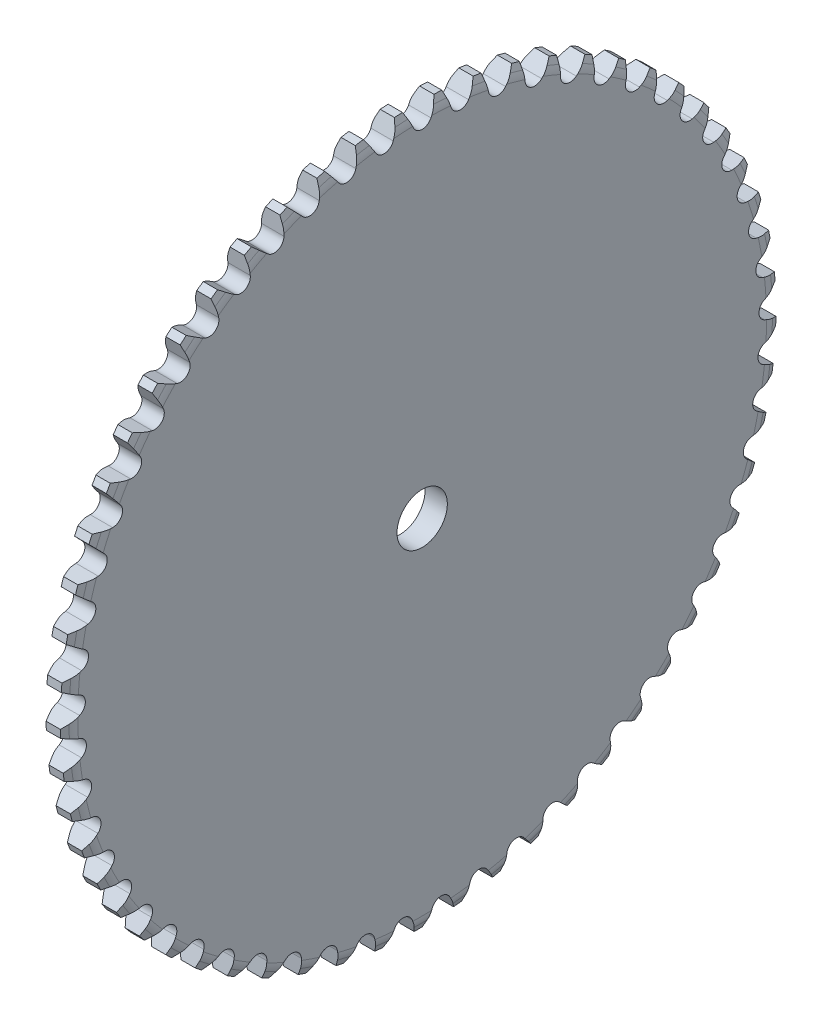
from build123d import *

# Parameters (mm, degrees)
ENL_V_MAT_EXTRU_1_DEPTH      = 11.1
ENL_V_MAT_EXTRU_1_DEPTH_BACK = 11.1
ESQUISSE2_R                  = 266.55


with BuildPart() as part:
    # Esquisse1 → R_volution1 (revolve)
    with BuildSketch(Plane.XY, mode=Mode.PRIVATE) as r_volution1_sk:
        with BuildLine():
            Line((0, 12.5), (11.1, 12.5))
            Line((11.1, 12.5), (11.1, 171.003171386))
            ThreePointArc((11.1, 171.003171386), (10.915171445, 172.867998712), (10.367877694, 174.660263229))
            Line((10.367877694, 174.660263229), (9.1, 177.7))
            Line((9.1, 177.7), (2, 177.7))
            Line((2, 177.7), (0.732122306, 174.660263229))
            ThreePointArc((0.732122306, 174.660263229), (0.184828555, 172.867998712), (0, 171.003171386))
            Line((0, 171.003171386), (0, 12.5))
        make_face()
    revolve(r_volution1_sk.sketch.rotate(Axis((11.1, 0, 0), (-1, 0, 0)), 180), axis=Axis((11.1, 0, 0), (-1, 0, 0)))

    # Esquisse2 → Enl_v. mat.-Extru.1 (cut, two sides: drawn at the far end of the back side and taken through both)
    with BuildSketch(Plane(origin=(5.55, 0, 0), x_dir=(0, 0, -1), z_dir=(1, 0, 0)).offset(-ENL_V_MAT_EXTRU_1_DEPTH_BACK)):
        Circle(ESQUISSE2_R)
        with BuildLine():
            Line((-177.676126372, -2.912750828), (-177.566785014, -6.879452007))
            Line((-177.566785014, -6.879452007), (-169.882751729, -9.716246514))
            ThreePointArc((-169.882751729, -9.716246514), (-166.764793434, -13.818524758), (-169.165014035, -18.378052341))
            Line((-169.165014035, -18.378052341), (-176.277326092, -22.440906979))
            Line((-176.277326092, -22.440906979), (-175.732278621, -26.37150452))
            Line((-175.732278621, -26.37150452), (-167.782811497, -28.345774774))
            ThreePointArc((-167.782811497, -28.345774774), (-164.232492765, -32.080153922), (-166.116560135, -36.87605226))
            Line((-166.116560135, -36.87605226), (-172.738757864, -41.696660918))
            Line((-172.738757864, -41.696660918), (-171.764620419, -45.543442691))
            Line((-171.764620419, -45.543442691), (-163.646215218, -46.631223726))
            ThreePointArc((-163.646215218, -46.631223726), (-159.706632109, -49.952373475), (-161.051676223, -54.926426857))
            Line((-161.051676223, -54.926426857), (-167.103375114, -60.446273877))
            Line((-167.103375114, -60.446273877), (-165.711972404, -64.162545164))
            Line((-165.711972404, -64.162545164), (-157.523175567, -64.350632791))
            ThreePointArc((-157.523175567, -64.350632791), (-153.242149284, -67.218238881), (-154.031843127, -72.310069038))
            Line((-154.031843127, -72.310069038), (-159.439583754, -78.462150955))
            Line((-159.439583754, -78.462150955), (-157.647805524, -82.002801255))
            Line((-157.647805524, -82.002801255), (-149.488017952, -81.288912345))
            ThreePointArc((-149.488017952, -81.288912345), (-144.917514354, -83.668165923), (-145.142272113, -88.815964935))
            Line((-145.142272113, -88.815964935), (-149.84041183, -95.525603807))
            Line((-149.84041183, -95.525603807), (-147.670007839, -98.847654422))
            Line((-147.670007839, -98.847654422), (-139.6382783, -97.240454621))
            ThreePointArc((-139.6382783, -97.240454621), (-134.83377711, -99.102474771), (-134.49087053, -104.243755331))
            Line((-134.49087053, -104.243755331), (-138.422380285, -111.429505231))
            Line((-138.422380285, -111.429505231), (-135.899696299, -114.492630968))
            Line((-135.899696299, -114.492630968), (-128.093519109, -112.011629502))
            ThreePointArc((-128.093519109, -112.011629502), (-123.113340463, -113.333813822), (-122.206931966, -118.406167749))
            Line((-122.206931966, -118.406167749), (-125.324088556, -125.980803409))
            Line((-125.324088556, -125.980803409), (-122.47974654, -128.747822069))
            Line((-122.47974654, -128.747822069), (-114.993878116, -125.423134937))
            ThreePointArc((-114.993878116, -125.423134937), (-109.898474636, -126.1894339), (-108.439566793, -131.131289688))
            Line((-108.439566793, -131.131289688), (-110.704532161, -139.002865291))
            Line((-110.704532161, -139.002865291), (-107.573058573, -141.440189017))
            Line((-107.573058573, -141.440189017), (-100.498367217, -137.312173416))
            ThreePointArc((-100.498367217, -137.312173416), (-95.3495902, -137.513285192), (-93.355892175, -142.264655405))
            Line((-93.355892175, -142.264655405), (-94.741172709, -150.337620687))
            Line((-94.741172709, -150.337620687), (-91.360579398, -152.41566367))
            Line((-91.360579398, -152.41566367), (-84.782942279, -147.534428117))
            ThreePointArc((-84.782942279, -147.534428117), (-79.643290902, -147.167911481), (-77.13900349, -151.671120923))
            Line((-77.13900349, -151.671120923), (-77.62778376, -159.84748102))
            Line((-77.62778376, -159.84748102), (-74.039106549, -161.541018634))
            Line((-74.039106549, -161.541018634), (-68.038367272, -155.965814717))
            ThreePointArc((-68.038367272, -155.965814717), (-62.970229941, -155.036118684), (-59.985751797, -159.236504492))
            Line((-59.985751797, -159.236504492), (-59.572098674, -167.417009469))
            Line((-59.572098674, -167.417009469), (-55.818899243, -168.705484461))
            Line((-55.818899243, -168.705484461), (-50.467898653, -162.503987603))
            ThreePointArc((-50.467898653, -162.503987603), (-45.53279569, -161.022397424), (-42.104354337, -164.868972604))
            Line((-42.104354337, -164.868972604), (-40.793289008, -172.954322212))
            Line((-40.793289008, -172.954322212), (-36.921126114, -173.822094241))
            Line((-36.921126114, -173.822094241), (-32.284818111, -167.069582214))
            ThreePointArc((-32.284818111, -167.069582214), (-27.542654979, -165.054082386), (-23.711867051, -168.500154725))
            Line((-23.711867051, -168.500154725), (-21.519304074, -176.392203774))
            Line((-21.519304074, -176.392203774), (-17.575180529, -176.828739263))
            Line((-17.575180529, -176.828739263), (-13.70984361, -169.607178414))
            ThreePointArc((-13.70984361, -169.607178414), (-9.218183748, -167.082234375), (-5.03154982, -170.085973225))
            Line((-5.03154982, -170.085973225), (-1.98410394, -177.688922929))
            Line((-1.98410394, -177.688922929), (1.98410394, -177.688922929))
            Line((1.98410394, -177.688922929), (5.03154982, -170.085973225))
            ThreePointArc((5.03154982, -170.085973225), (9.218183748, -167.082234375), (13.70984361, -169.607178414))
            Line((13.70984361, -169.607178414), (17.575180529, -176.828739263))
            Line((17.575180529, -176.828739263), (21.519304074, -176.392203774))
            Line((21.519304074, -176.392203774), (23.711867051, -168.500154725))
            ThreePointArc((23.711867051, -168.500154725), (27.542654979, -165.054082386), (32.284818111, -167.069582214))
            Line((32.284818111, -167.069582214), (36.921126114, -173.822094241))
            Line((36.921126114, -173.822094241), (40.793289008, -172.954322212))
            Line((40.793289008, -172.954322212), (42.104354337, -164.868972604))
            ThreePointArc((42.104354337, -164.868972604), (45.53279569, -161.022397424), (50.467898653, -162.503987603))
            Line((50.467898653, -162.503987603), (55.818899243, -168.705484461))
            Line((55.818899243, -168.705484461), (59.572098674, -167.417009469))
            Line((59.572098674, -167.417009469), (59.985751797, -159.236504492))
            ThreePointArc((59.985751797, -159.236504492), (62.970229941, -155.036118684), (68.038367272, -155.965814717))
            Line((68.038367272, -155.965814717), (74.039106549, -161.541018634))
            Line((74.039106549, -161.541018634), (77.62778376, -159.84748102))
            Line((77.62778376, -159.84748102), (77.13900349, -151.671120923))
            ThreePointArc((77.13900349, -151.671120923), (79.643290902, -147.167911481), (84.782942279, -147.534428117))
            Line((84.782942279, -147.534428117), (91.360579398, -152.41566367))
            Line((91.360579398, -152.41566367), (94.741172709, -150.337620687))
            Line((94.741172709, -150.337620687), (93.355892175, -142.264655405))
            ThreePointArc((93.355892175, -142.264655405), (95.3495902, -137.513285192), (100.498367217, -137.312173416))
            Line((100.498367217, -137.312173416), (107.573058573, -141.440189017))
            Line((107.573058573, -141.440189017), (110.704532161, -139.002865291))
            Line((110.704532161, -139.002865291), (108.439566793, -131.131289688))
            ThreePointArc((108.439566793, -131.131289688), (109.898474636, -126.1894339), (114.993878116, -125.423134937))
            Line((114.993878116, -125.423134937), (122.47974654, -128.747822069))
            Line((122.47974654, -128.747822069), (125.324088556, -125.980803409))
            Line((125.324088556, -125.980803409), (122.206931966, -118.406167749))
            ThreePointArc((122.206931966, -118.406167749), (123.113340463, -113.333813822), (128.093519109, -112.011629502))
            Line((128.093519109, -112.011629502), (135.899696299, -114.492630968))
            Line((135.899696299, -114.492630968), (138.422380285, -111.429505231))
            Line((138.422380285, -111.429505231), (134.49087053, -104.243755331))
            ThreePointArc((134.49087053, -104.243755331), (134.83377711, -99.102474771), (139.6382783, -97.240454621))
            Line((139.6382783, -97.240454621), (147.670007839, -98.847654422))
            Line((147.670007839, -98.847654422), (149.84041183, -95.525603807))
            Line((149.84041183, -95.525603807), (145.142272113, -88.815964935))
            ThreePointArc((145.142272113, -88.815964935), (144.917514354, -83.668165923), (149.488017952, -81.288912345))
            Line((149.488017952, -81.288912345), (157.647805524, -82.002801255))
            Line((157.647805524, -82.002801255), (159.439583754, -78.462150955))
            Line((159.439583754, -78.462150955), (154.031843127, -72.310069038))
            ThreePointArc((154.031843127, -72.310069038), (153.242149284, -67.218238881), (157.523175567, -64.350632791))
            Line((157.523175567, -64.350632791), (165.711972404, -64.162545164))
            Line((165.711972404, -64.162545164), (167.103375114, -60.446273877))
            Line((167.103375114, -60.446273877), (161.051676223, -54.926426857))
            ThreePointArc((161.051676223, -54.926426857), (159.706632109, -49.952373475), (163.646215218, -46.631223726))
            Line((163.646215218, -46.631223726), (171.764620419, -45.543442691))
            Line((171.764620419, -45.543442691), (172.738757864, -41.696660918))
            Line((172.738757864, -41.696660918), (166.116560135, -36.87605226))
            ThreePointArc((166.116560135, -36.87605226), (164.232492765, -32.080153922), (167.782811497, -28.345774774))
            Line((167.782811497, -28.345774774), (175.732278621, -26.37150452))
            Line((175.732278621, -26.37150452), (176.277326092, -22.440906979))
            Line((176.277326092, -22.440906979), (169.165014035, -18.378052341))
            ThreePointArc((169.165014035, -18.378052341), (166.764793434, -13.818524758), (169.882751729, -9.716246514))
            Line((169.882751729, -9.716246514), (177.566785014, -6.879452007))
            Line((177.566785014, -6.879452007), (177.676126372, -2.912750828))
            Line((177.676126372, -2.912750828), (170.160033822, 0.343032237))
            ThreePointArc((170.160033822, 0.343032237), (167.272795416, 4.610842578), (169.920545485, 9.031223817))
            Line((169.920545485, 9.031223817), (177.245871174, 12.696107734))
            Line((177.245871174, 12.696107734), (176.918179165, 16.650762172))
            Line((176.918179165, 16.650762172), (169.089541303, 19.059952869))
            ThreePointArc((169.089541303, 19.059952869), (165.750332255, 22.984240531), (167.895733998, 27.669067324))
            Line((167.895733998, 27.669067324), (174.773432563, 32.117553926))
            Line((174.773432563, 32.117553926), (174.012684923, 36.012157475))
            Line((174.012684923, 36.012157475), (165.966530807, 37.545511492))
            ThreePointArc((165.966530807, 37.545511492), (162.215884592, 41.078640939), (163.832895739, 45.971045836))
            Line((163.832895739, 45.971045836), (170.179481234, 51.149136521))
            Line((170.179481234, 51.149136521), (168.994912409, 54.936413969))
            Line((168.994912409, 54.936413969), (160.828911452, 55.575318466))
            ThreePointArc((160.828911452, 55.575318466), (156.712355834, 58.674402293), (157.781348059, 63.714998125))
            Line((157.781348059, 63.714998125), (163.519781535, 69.559837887))
            Line((163.519781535, 69.559837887), (161.925770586, 73.193816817))
            Line((161.925770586, 73.193816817), (153.739046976, 72.930516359))
            ThreePointArc((153.739046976, 72.930516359), (149.306551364, 75.557935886), (149.81454855, 80.685536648))
            Line((149.81454855, 80.685536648), (154.875173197, 87.126177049))
            Line((154.875173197, 87.126177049), (152.891069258, 90.56274588))
            Line((152.891069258, 90.56274588), (144.78299873, 89.400436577))
            ThreePointArc((144.78299873, 89.400436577), (140.088367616, 91.52429849), (140.029203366, 96.676662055))
            Line((140.029203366, 96.676662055), (144.350590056, 103.634922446))
            Line((144.350590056, 103.634922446), (142.00047746, 106.832365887))
            Line((142.00047746, 106.832365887), (134.069481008, 104.7851566))
            ThreePointArc((134.069481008, 104.7851566), (129.169700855, 106.379680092), (128.544093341, 111.494263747))
            Line((128.544093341, 111.494263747), (132.073786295, 118.885680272))
            Line((132.073786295, 118.885680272), (129.386192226, 121.805185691))
            Line((129.386192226, 121.805185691), (121.728541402, 118.897926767))
            ThreePointArc((121.728541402, 118.897926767), (116.683088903, 119.943756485), (115.498632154, 124.958476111))
            Line((115.498632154, 124.958476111), (118.19378568, 132.693326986))
            Line((118.19378568, 132.693326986), (115.201333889, 135.299455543))
            Line((115.201333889, 135.299455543), (107.909982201, 131.567437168))
            ThreePointArc((107.909982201, 131.567437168), (102.780102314, 132.051878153), (101.051174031, 136.905861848))
            Line((101.051174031, 136.905861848), (102.879072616, 144.890256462))
            Line((102.879072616, 144.890256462), (99.618087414, 147.151373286))
            Line((99.618087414, 147.151373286), (92.781541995, 142.639897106))
            ThreePointArc((92.781541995, 142.639897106), (87.629504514, 142.557068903), (85.377091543, 147.19139588))
            Line((85.377091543, 147.19139588), (86.315546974, 155.328414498))
            Line((86.315546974, 155.328414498), (82.825612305, 157.217072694))
            Line((82.825612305, 157.217072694), (76.526859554, 151.980901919))
            ThreePointArc((76.526859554, 151.980901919), (71.415203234, 151.331809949), (68.666646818, 155.690225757))
            Line((68.666646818, 155.690225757), (68.704267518, 163.881095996))
            Line((68.704267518, 163.881095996), (65.027746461, 165.374369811))
            Line((65.027746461, 165.374369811), (59.343244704, 159.477064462))
            ThreePointArc((59.343244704, 159.477064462), (54.334018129, 158.269587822), (51.12268202, 162.299187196))
            Line((51.12268202, 162.299187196), (50.259011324, 170.444482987))
            Line((50.259011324, 170.444482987), (46.440531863, 171.5242461))
            Line((46.440531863, 171.5242461), (41.439283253, 165.037391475))
            ThreePointArc((41.439283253, 165.037391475), (36.593291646, 163.286187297), (32.958157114, 166.93805636))
            Line((32.958157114, 166.93805636), (31.203678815, 174.938904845))
            Line((31.203678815, 174.938904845), (27.289592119, 175.592050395))
            Line((27.289592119, 175.592050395), (23.032305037, 168.594388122))
            ThreePointArc((23.032305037, 168.594388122), (18.408372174, 166.320713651), (14.393564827, 169.550523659))
            Line((14.393564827, 169.550523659), (11.769575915, 177.309805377))
            Line((11.769575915, 177.309805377), (7.807393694, 177.528405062))
            Line((7.807393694, 177.528405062), (4.345745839, 170.10487728))
            ThreePointArc((4.345745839, 170.10487728), (0, 167.336331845), (-4.345745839, 170.10487728))
            Line((-4.345745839, 170.10487728), (-7.807393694, 177.528405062))
            Line((-7.807393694, 177.528405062), (-11.769575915, 177.309805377))
            Line((-11.769575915, 177.309805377), (-14.393564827, 169.550523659))
            ThreePointArc((-14.393564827, 169.550523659), (-18.408372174, 166.320713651), (-23.032305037, 168.594388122))
            Line((-23.032305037, 168.594388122), (-27.289592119, 175.592050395))
            Line((-27.289592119, 175.592050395), (-31.203678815, 174.938904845))
            Line((-31.203678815, 174.938904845), (-32.958157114, 166.93805636))
            ThreePointArc((-32.958157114, 166.93805636), (-36.593291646, 163.286187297), (-41.439283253, 165.037391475))
            Line((-41.439283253, 165.037391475), (-46.440531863, 171.5242461))
            Line((-46.440531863, 171.5242461), (-50.259011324, 170.444482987))
            Line((-50.259011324, 170.444482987), (-51.12268202, 162.299187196))
            ThreePointArc((-51.12268202, 162.299187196), (-54.334018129, 158.269587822), (-59.343244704, 159.477064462))
            Line((-59.343244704, 159.477064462), (-65.027746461, 165.374369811))
            Line((-65.027746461, 165.374369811), (-68.704267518, 163.881095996))
            Line((-68.704267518, 163.881095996), (-68.666646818, 155.690225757))
            ThreePointArc((-68.666646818, 155.690225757), (-71.415203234, 151.331809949), (-76.526859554, 151.980901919))
            Line((-76.526859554, 151.980901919), (-82.825612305, 157.217072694))
            Line((-82.825612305, 157.217072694), (-86.315546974, 155.328414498))
            Line((-86.315546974, 155.328414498), (-85.377091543, 147.19139588))
            ThreePointArc((-85.377091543, 147.19139588), (-87.629504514, 142.557068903), (-92.781541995, 142.639897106))
            Line((-92.781541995, 142.639897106), (-99.618087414, 147.151373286))
            Line((-99.618087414, 147.151373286), (-102.879072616, 144.890256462))
            Line((-102.879072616, 144.890256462), (-101.051174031, 136.905861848))
            ThreePointArc((-101.051174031, 136.905861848), (-102.780102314, 132.051878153), (-107.909982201, 131.567437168))
            Line((-107.909982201, 131.567437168), (-115.201333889, 135.299455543))
            Line((-115.201333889, 135.299455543), (-118.19378568, 132.693326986))
            Line((-118.19378568, 132.693326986), (-115.498632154, 124.958476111))
            ThreePointArc((-115.498632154, 124.958476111), (-116.683088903, 119.943756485), (-121.728541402, 118.897926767))
            Line((-121.728541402, 118.897926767), (-129.386192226, 121.805185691))
            Line((-129.386192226, 121.805185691), (-132.073786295, 118.885680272))
            Line((-132.073786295, 118.885680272), (-128.544093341, 111.494263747))
            ThreePointArc((-128.544093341, 111.494263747), (-129.169700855, 106.379680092), (-134.069481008, 104.7851566))
            Line((-134.069481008, 104.7851566), (-142.00047746, 106.832365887))
            Line((-142.00047746, 106.832365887), (-144.350590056, 103.634922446))
            Line((-144.350590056, 103.634922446), (-140.029203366, 96.676662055))
            ThreePointArc((-140.029203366, 96.676662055), (-140.088367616, 91.52429849), (-144.78299873, 89.400436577))
            Line((-144.78299873, 89.400436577), (-152.891069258, 90.56274588))
            Line((-152.891069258, 90.56274588), (-154.875173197, 87.126177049))
            Line((-154.875173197, 87.126177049), (-149.81454855, 80.685536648))
            ThreePointArc((-149.81454855, 80.685536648), (-149.306551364, 75.557935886), (-153.739046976, 72.930516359))
            Line((-153.739046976, 72.930516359), (-161.925770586, 73.193816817))
            Line((-161.925770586, 73.193816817), (-163.519781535, 69.559837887))
            Line((-163.519781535, 69.559837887), (-157.781348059, 63.714998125))
            ThreePointArc((-157.781348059, 63.714998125), (-156.712355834, 58.674402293), (-160.828911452, 55.575318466))
            Line((-160.828911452, 55.575318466), (-168.994912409, 54.936413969))
            Line((-168.994912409, 54.936413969), (-170.179481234, 51.149136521))
            Line((-170.179481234, 51.149136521), (-163.832895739, 45.971045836))
            ThreePointArc((-163.832895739, 45.971045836), (-162.215884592, 41.078640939), (-165.966530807, 37.545511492))
            Line((-165.966530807, 37.545511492), (-174.012684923, 36.012157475))
            Line((-174.012684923, 36.012157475), (-174.773432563, 32.117553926))
            Line((-174.773432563, 32.117553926), (-167.895733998, 27.669067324))
            ThreePointArc((-167.895733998, 27.669067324), (-165.750332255, 22.984240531), (-169.089541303, 19.059952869))
            Line((-169.089541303, 19.059952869), (-176.918179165, 16.650762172))
            Line((-176.918179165, 16.650762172), (-177.245871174, 12.696107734))
            Line((-177.245871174, 12.696107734), (-169.920545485, 9.031223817))
            ThreePointArc((-169.920545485, 9.031223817), (-167.272795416, 4.610842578), (-170.160033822, 0.343032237))
            Line((-170.160033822, 0.343032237), (-177.676126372, -2.912750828))
        make_face(mode=Mode.SUBTRACT)
    extrude(amount=ENL_V_MAT_EXTRU_1_DEPTH + ENL_V_MAT_EXTRU_1_DEPTH_BACK, mode=Mode.SUBTRACT)


solid = part.part
